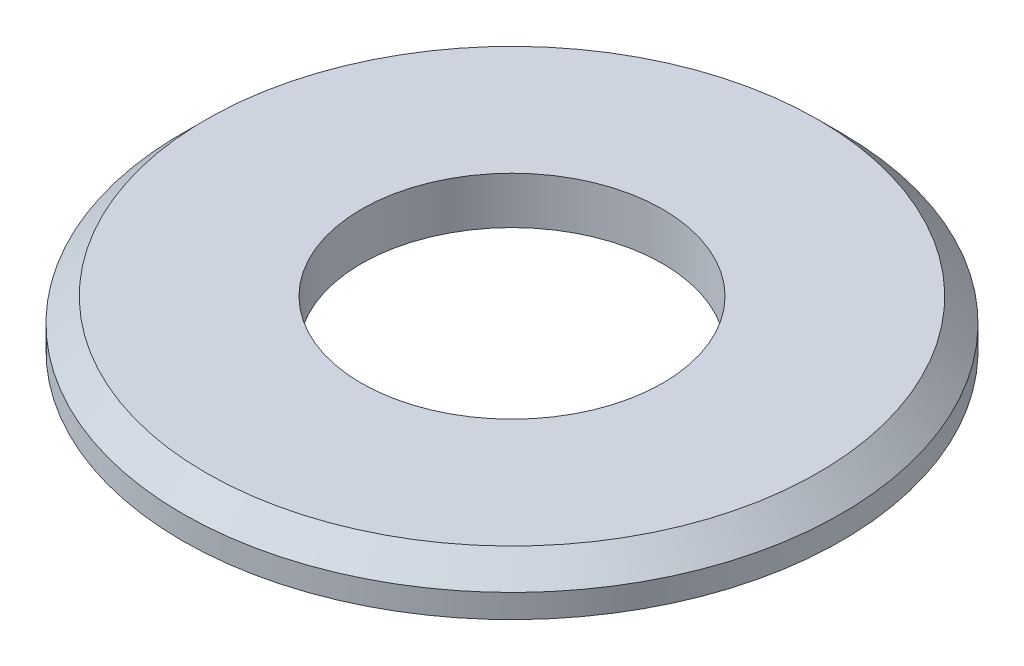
ISO-10303-21;
HEADER;
FILE_DESCRIPTION(('STEP AP214'),'2;1');
FILE_NAME('part.step','',(''),(''),'','','');
FILE_SCHEMA(('AUTOMOTIVE_DESIGN { 1 0 10303 214 1 1 1 1 }'));
ENDSEC;
DATA;
#1=APPLICATION_CONTEXT('core data for automotive mechanical design processes');
#2=APPLICATION_PROTOCOL_DEFINITION('international standard','automotive_design',2000,#1);
#3=PRODUCT_CONTEXT('',#1,'mechanical');
#4=PRODUCT('Part','Part','',(#3));
#5=PRODUCT_RELATED_PRODUCT_CATEGORY('part','',(#4));
#6=PRODUCT_DEFINITION_FORMATION('','',#4);
#7=PRODUCT_DEFINITION_CONTEXT('part definition',#1,'design');
#8=PRODUCT_DEFINITION('design','',#6,#7);
#9=PRODUCT_DEFINITION_SHAPE('','',#8);
#10=(LENGTH_UNIT() NAMED_UNIT(*) SI_UNIT(.MILLI.,.METRE.));
#11=(NAMED_UNIT(*) PLANE_ANGLE_UNIT() SI_UNIT($,.RADIAN.));
#12=(NAMED_UNIT(*) SI_UNIT($,.STERADIAN.) SOLID_ANGLE_UNIT());
#13=UNCERTAINTY_MEASURE_WITH_UNIT(LENGTH_MEASURE(1.E-05),#10,'distance_accuracy_value','');
#14=(GEOMETRIC_REPRESENTATION_CONTEXT(3) GLOBAL_UNCERTAINTY_ASSIGNED_CONTEXT((#13)) GLOBAL_UNIT_ASSIGNED_CONTEXT((#10,
#11,#12)) REPRESENTATION_CONTEXT('',''));
#15=CARTESIAN_POINT('',(0.,0.,0.));
#16=DIRECTION('',(0.,0.,1.));
#17=DIRECTION('',(1.,0.,0.));
#18=AXIS2_PLACEMENT_3D('',#15,#16,#17);
#19=CARTESIAN_POINT('',(0.,0.5,0.));
#20=DIRECTION('',(0.,1.,0.));
#21=DIRECTION('',(0.,0.,1.));
#22=AXIS2_PLACEMENT_3D('',#19,#20,#21);
#23=PLANE('',#22);
#24=CARTESIAN_POINT('',(0.,0.5,0.));
#25=DIRECTION('',(0.,1.,0.));
#26=DIRECTION('',(0.,0.,1.));
#27=AXIS2_PLACEMENT_3D('',#24,#25,#26);
#28=CIRCLE('',#27,3.25);
#29=CARTESIAN_POINT('',(0.,0.5,3.25));
#30=VERTEX_POINT('',#29);
#31=EDGE_CURVE('E35',#30,#30,#28,.T.);
#32=ORIENTED_EDGE('',*,*,#31,.T.);
#33=EDGE_LOOP('',(#32));
#34=FACE_BOUND('',#33,.T.);
#35=CARTESIAN_POINT('',(0.,0.5,0.));
#36=DIRECTION('',(0.,1.,0.));
#37=DIRECTION('',(0.,0.,1.));
#38=AXIS2_PLACEMENT_3D('',#35,#36,#37);
#39=CIRCLE('',#38,1.6);
#40=CARTESIAN_POINT('',(0.,0.5,1.6));
#41=VERTEX_POINT('',#40);
#42=EDGE_CURVE('E43',#41,#41,#39,.T.);
#43=ORIENTED_EDGE('',*,*,#42,.F.);
#44=EDGE_LOOP('',(#43));
#45=FACE_BOUND('',#44,.T.);
#46=ADVANCED_FACE('F28',(#34,#45),#23,.T.);
#47=CARTESIAN_POINT('',(0.,0.,0.));
#48=DIRECTION('',(0.,1.,0.));
#49=DIRECTION('',(0.,0.,1.));
#50=AXIS2_PLACEMENT_3D('',#47,#48,#49);
#51=PLANE('',#50);
#52=CARTESIAN_POINT('',(0.,0.,0.));
#53=DIRECTION('',(0.,1.,0.));
#54=DIRECTION('',(0.,0.,1.));
#55=AXIS2_PLACEMENT_3D('',#52,#53,#54);
#56=CIRCLE('',#55,3.5);
#57=CARTESIAN_POINT('',(0.,0.,3.5));
#58=VERTEX_POINT('',#57);
#59=EDGE_CURVE('E39',#58,#58,#56,.T.);
#60=ORIENTED_EDGE('',*,*,#59,.F.);
#61=EDGE_LOOP('',(#60));
#62=FACE_BOUND('',#61,.T.);
#63=CARTESIAN_POINT('',(0.,0.,0.));
#64=DIRECTION('',(0.,1.,0.));
#65=DIRECTION('',(0.,0.,1.));
#66=AXIS2_PLACEMENT_3D('',#63,#64,#65);
#67=CIRCLE('',#66,1.6);
#68=CARTESIAN_POINT('',(0.,0.,1.6));
#69=VERTEX_POINT('',#68);
#70=EDGE_CURVE('E48',#69,#69,#67,.T.);
#71=ORIENTED_EDGE('',*,*,#70,.T.);
#72=EDGE_LOOP('',(#71));
#73=FACE_BOUND('',#72,.T.);
#74=ADVANCED_FACE('F52',(#62,#73),#51,.F.);
#75=CARTESIAN_POINT('',(0.,0.5,0.));
#76=DIRECTION('',(0.,-1.,0.));
#77=DIRECTION('',(0.,0.,-1.));
#78=AXIS2_PLACEMENT_3D('',#75,#76,#77);
#79=CYLINDRICAL_SURFACE('',#78,3.5);
#80=CARTESIAN_POINT('',(0.,0.25,0.));
#81=DIRECTION('',(0.,1.,0.));
#82=DIRECTION('',(0.,0.,1.));
#83=AXIS2_PLACEMENT_3D('',#80,#81,#82);
#84=CIRCLE('',#83,3.5);
#85=CARTESIAN_POINT('',(0.,0.25,3.5));
#86=VERTEX_POINT('',#85);
#87=EDGE_CURVE('E10',#86,#86,#84,.F.);
#88=ORIENTED_EDGE('',*,*,#87,.T.);
#89=EDGE_LOOP('',(#88));
#90=FACE_BOUND('',#89,.T.);
#91=ORIENTED_EDGE('',*,*,#59,.T.);
#92=EDGE_LOOP('',(#91));
#93=FACE_BOUND('',#92,.T.);
#94=ADVANCED_FACE('F30',(#90,#93),#79,.T.);
#95=CARTESIAN_POINT('',(0.,0.5,0.));
#96=DIRECTION('',(0.,-1.,0.));
#97=DIRECTION('',(0.,0.,-1.));
#98=AXIS2_PLACEMENT_3D('',#95,#96,#97);
#99=CYLINDRICAL_SURFACE('',#98,1.6);
#100=ORIENTED_EDGE('',*,*,#42,.T.);
#101=EDGE_LOOP('',(#100));
#102=FACE_BOUND('',#101,.T.);
#103=ORIENTED_EDGE('',*,*,#70,.F.);
#104=EDGE_LOOP('',(#103));
#105=FACE_BOUND('',#104,.T.);
#106=ADVANCED_FACE('F54',(#102,#105),#99,.F.);
#107=CARTESIAN_POINT('',(0.,0.5,0.));
#108=DIRECTION('',(0.,-1.,0.));
#109=DIRECTION('',(0.,0.,-1.));
#110=AXIS2_PLACEMENT_3D('',#107,#108,#109);
#111=CONICAL_SURFACE('',#110,3.25,0.785398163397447);
#112=ORIENTED_EDGE('',*,*,#87,.F.);
#113=EDGE_LOOP('',(#112));
#114=FACE_BOUND('',#113,.T.);
#115=ORIENTED_EDGE('',*,*,#31,.F.);
#116=EDGE_LOOP('',(#115));
#117=FACE_BOUND('',#116,.T.);
#118=ADVANCED_FACE('F56',(#114,#117),#111,.T.);
#119=CLOSED_SHELL('',(#46,#74,#94,#106,#118));
#120=MANIFOLD_SOLID_BREP('B2',#119);
#121=ADVANCED_BREP_SHAPE_REPRESENTATION('',(#18,#120),#14);
#122=SHAPE_DEFINITION_REPRESENTATION(#9,#121);
ENDSEC;
END-ISO-10303-21;
